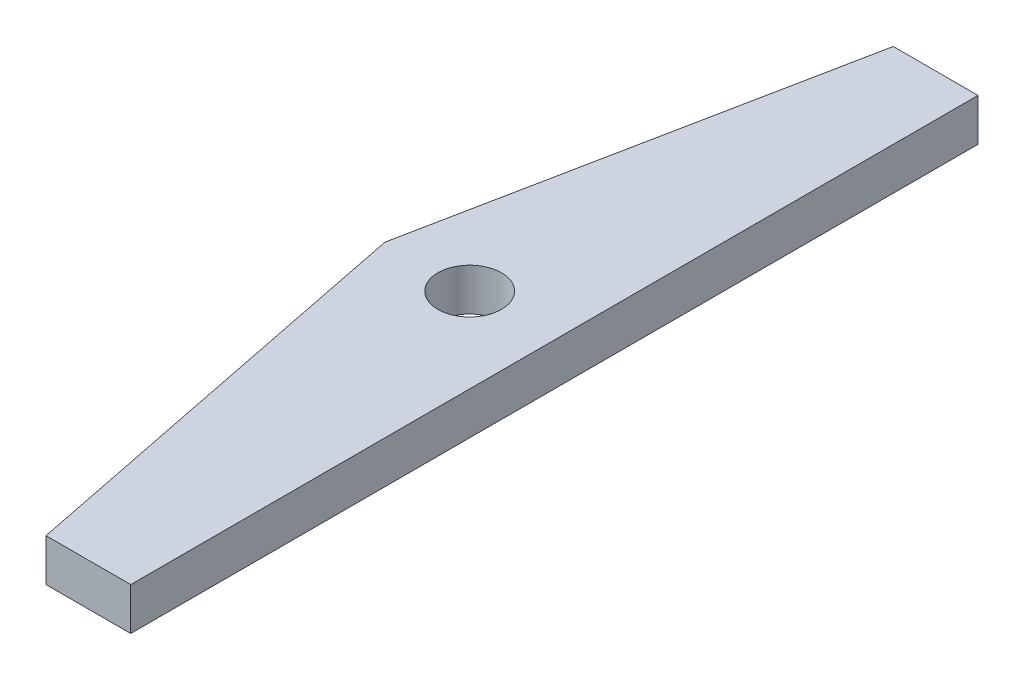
ISO-10303-21;
HEADER;
FILE_DESCRIPTION(('STEP AP214'),'2;1');
FILE_NAME('part.step','',(''),(''),'','','');
FILE_SCHEMA(('AUTOMOTIVE_DESIGN { 1 0 10303 214 1 1 1 1 }'));
ENDSEC;
DATA;
#1=APPLICATION_CONTEXT('core data for automotive mechanical design processes');
#2=APPLICATION_PROTOCOL_DEFINITION('international standard','automotive_design',2000,#1);
#3=PRODUCT_CONTEXT('',#1,'mechanical');
#4=PRODUCT('Part','Part','',(#3));
#5=PRODUCT_RELATED_PRODUCT_CATEGORY('part','',(#4));
#6=PRODUCT_DEFINITION_FORMATION('','',#4);
#7=PRODUCT_DEFINITION_CONTEXT('part definition',#1,'design');
#8=PRODUCT_DEFINITION('design','',#6,#7);
#9=PRODUCT_DEFINITION_SHAPE('','',#8);
#10=(LENGTH_UNIT() NAMED_UNIT(*) SI_UNIT(.MILLI.,.METRE.));
#11=(NAMED_UNIT(*) PLANE_ANGLE_UNIT() SI_UNIT($,.RADIAN.));
#12=(NAMED_UNIT(*) SI_UNIT($,.STERADIAN.) SOLID_ANGLE_UNIT());
#13=UNCERTAINTY_MEASURE_WITH_UNIT(LENGTH_MEASURE(1.E-05),#10,'distance_accuracy_value','');
#14=(GEOMETRIC_REPRESENTATION_CONTEXT(3) GLOBAL_UNCERTAINTY_ASSIGNED_CONTEXT((#13)) GLOBAL_UNIT_ASSIGNED_CONTEXT((#10,
#11,#12)) REPRESENTATION_CONTEXT('',''));
#15=CARTESIAN_POINT('',(0.,0.,0.));
#16=DIRECTION('',(0.,0.,1.));
#17=DIRECTION('',(1.,0.,0.));
#18=AXIS2_PLACEMENT_3D('',#15,#16,#17);
#19=CARTESIAN_POINT('',(0.,3.,-30.));
#20=DIRECTION('',(0.,-1.,0.));
#21=DIRECTION('',(0.,0.,-1.));
#22=AXIS2_PLACEMENT_3D('',#19,#20,#21);
#23=PLANE('',#22);
#24=DIRECTION('',(-1.,0.,0.));
#25=VECTOR('',#24,1.);
#26=CARTESIAN_POINT('',(0.,3.,-30.));
#27=LINE('',#26,#25);
#28=CARTESIAN_POINT('',(0.,3.,-30.));
#29=VERTEX_POINT('',#28);
#30=CARTESIAN_POINT('',(-6.,3.,-30.));
#31=VERTEX_POINT('',#30);
#32=EDGE_CURVE('E115',#29,#31,#27,.T.);
#33=ORIENTED_EDGE('',*,*,#32,.T.);
#34=DIRECTION('',(-0.196116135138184,0.,0.98058067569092));
#35=VECTOR('',#34,1.);
#36=CARTESIAN_POINT('',(-6.,3.,-30.));
#37=LINE('',#36,#35);
#38=CARTESIAN_POINT('',(-12.,3.,0.));
#39=VERTEX_POINT('',#38);
#40=EDGE_CURVE('E82',#31,#39,#37,.T.);
#41=ORIENTED_EDGE('',*,*,#40,.T.);
#42=DIRECTION('',(0.196116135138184,0.,0.98058067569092));
#43=VECTOR('',#42,1.);
#44=CARTESIAN_POINT('',(-6.,3.,30.));
#45=LINE('',#44,#43);
#46=CARTESIAN_POINT('',(-6.,3.,30.));
#47=VERTEX_POINT('',#46);
#48=EDGE_CURVE('E86',#39,#47,#45,.T.);
#49=ORIENTED_EDGE('',*,*,#48,.T.);
#50=DIRECTION('',(1.,0.,0.));
#51=VECTOR('',#50,1.);
#52=CARTESIAN_POINT('',(0.,3.,30.));
#53=LINE('',#52,#51);
#54=CARTESIAN_POINT('',(0.,3.,30.));
#55=VERTEX_POINT('',#54);
#56=EDGE_CURVE('E90',#47,#55,#53,.T.);
#57=ORIENTED_EDGE('',*,*,#56,.T.);
#58=DIRECTION('',(0.,0.,-1.));
#59=VECTOR('',#58,1.);
#60=CARTESIAN_POINT('',(0.,3.,30.));
#61=LINE('',#60,#59);
#62=EDGE_CURVE('E48',#55,#29,#61,.T.);
#63=ORIENTED_EDGE('',*,*,#62,.T.);
#64=EDGE_LOOP('',(#33,#41,#49,#57,#63));
#65=FACE_BOUND('',#64,.T.);
#66=CARTESIAN_POINT('',(-6.,3.,0.));
#67=DIRECTION('',(0.,1.,0.));
#68=DIRECTION('',(0.,0.,1.));
#69=AXIS2_PLACEMENT_3D('',#66,#67,#68);
#70=CIRCLE('',#69,2.25);
#71=CARTESIAN_POINT('',(-6.,3.,2.25));
#72=VERTEX_POINT('',#71);
#73=EDGE_CURVE('E110',#72,#72,#70,.T.);
#74=ORIENTED_EDGE('',*,*,#73,.F.);
#75=EDGE_LOOP('',(#74));
#76=FACE_BOUND('',#75,.T.);
#77=ADVANCED_FACE('F31',(#65,#76),#23,.F.);
#78=CARTESIAN_POINT('',(0.,0.,-30.));
#79=DIRECTION('',(0.,-1.,0.));
#80=DIRECTION('',(0.,0.,-1.));
#81=AXIS2_PLACEMENT_3D('',#78,#79,#80);
#82=PLANE('',#81);
#83=DIRECTION('',(-1.,0.,0.));
#84=VECTOR('',#83,1.);
#85=CARTESIAN_POINT('',(0.,0.,-30.));
#86=LINE('',#85,#84);
#87=CARTESIAN_POINT('',(0.,0.,-30.));
#88=VERTEX_POINT('',#87);
#89=CARTESIAN_POINT('',(-6.,0.,-30.));
#90=VERTEX_POINT('',#89);
#91=EDGE_CURVE('E106',#88,#90,#86,.T.);
#92=ORIENTED_EDGE('',*,*,#91,.F.);
#93=DIRECTION('',(0.,0.,-1.));
#94=VECTOR('',#93,1.);
#95=CARTESIAN_POINT('',(0.,0.,30.));
#96=LINE('',#95,#94);
#97=CARTESIAN_POINT('',(0.,0.,30.));
#98=VERTEX_POINT('',#97);
#99=EDGE_CURVE('E74',#98,#88,#96,.T.);
#100=ORIENTED_EDGE('',*,*,#99,.F.);
#101=DIRECTION('',(1.,0.,0.));
#102=VECTOR('',#101,1.);
#103=CARTESIAN_POINT('',(0.,0.,30.));
#104=LINE('',#103,#102);
#105=CARTESIAN_POINT('',(-6.,0.,30.));
#106=VERTEX_POINT('',#105);
#107=EDGE_CURVE('E68',#106,#98,#104,.T.);
#108=ORIENTED_EDGE('',*,*,#107,.F.);
#109=DIRECTION('',(0.196116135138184,0.,0.98058067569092));
#110=VECTOR('',#109,1.);
#111=CARTESIAN_POINT('',(-6.,0.,30.));
#112=LINE('',#111,#110);
#113=CARTESIAN_POINT('',(-12.,0.,0.));
#114=VERTEX_POINT('',#113);
#115=EDGE_CURVE('E97',#114,#106,#112,.T.);
#116=ORIENTED_EDGE('',*,*,#115,.F.);
#117=DIRECTION('',(-0.196116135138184,0.,0.98058067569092));
#118=VECTOR('',#117,1.);
#119=CARTESIAN_POINT('',(-6.,0.,-30.));
#120=LINE('',#119,#118);
#121=EDGE_CURVE('E109',#90,#114,#120,.T.);
#122=ORIENTED_EDGE('',*,*,#121,.F.);
#123=EDGE_LOOP('',(#92,#100,#108,#116,#122));
#124=FACE_BOUND('',#123,.T.);
#125=CARTESIAN_POINT('',(-6.,0.,0.));
#126=DIRECTION('',(0.,1.,0.));
#127=DIRECTION('',(0.,0.,1.));
#128=AXIS2_PLACEMENT_3D('',#125,#126,#127);
#129=CIRCLE('',#128,2.25);
#130=CARTESIAN_POINT('',(-6.,0.,2.25));
#131=VERTEX_POINT('',#130);
#132=EDGE_CURVE('E195',#131,#131,#129,.T.);
#133=ORIENTED_EDGE('',*,*,#132,.T.);
#134=EDGE_LOOP('',(#133));
#135=FACE_BOUND('',#134,.T.);
#136=ADVANCED_FACE('F119',(#124,#135),#82,.T.);
#137=CARTESIAN_POINT('',(0.,3.,-30.));
#138=DIRECTION('',(0.,0.,1.));
#139=DIRECTION('',(1.,0.,0.));
#140=AXIS2_PLACEMENT_3D('',#137,#138,#139);
#141=PLANE('',#140);
#142=ORIENTED_EDGE('',*,*,#91,.T.);
#143=DIRECTION('',(0.,-1.,0.));
#144=VECTOR('',#143,1.);
#145=CARTESIAN_POINT('',(-6.,3.,-30.));
#146=LINE('',#145,#144);
#147=EDGE_CURVE('E11',#31,#90,#146,.T.);
#148=ORIENTED_EDGE('',*,*,#147,.F.);
#149=ORIENTED_EDGE('',*,*,#32,.F.);
#150=DIRECTION('',(0.,-1.,0.));
#151=VECTOR('',#150,1.);
#152=CARTESIAN_POINT('',(0.,3.,-30.));
#153=LINE('',#152,#151);
#154=EDGE_CURVE('E102',#29,#88,#153,.T.);
#155=ORIENTED_EDGE('',*,*,#154,.T.);
#156=EDGE_LOOP('',(#142,#148,#149,#155));
#157=FACE_BOUND('',#156,.T.);
#158=ADVANCED_FACE('F33',(#157),#141,.F.);
#159=CARTESIAN_POINT('',(-6.,3.,-30.));
#160=DIRECTION('',(0.98058067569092,0.,0.196116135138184));
#161=DIRECTION('',(0.196116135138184,0.,-0.98058067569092));
#162=AXIS2_PLACEMENT_3D('',#159,#160,#161);
#163=PLANE('',#162);
#164=ORIENTED_EDGE('',*,*,#121,.T.);
#165=DIRECTION('',(0.,-1.,0.));
#166=VECTOR('',#165,1.);
#167=CARTESIAN_POINT('',(-12.,3.,0.));
#168=LINE('',#167,#166);
#169=EDGE_CURVE('E40',#39,#114,#168,.T.);
#170=ORIENTED_EDGE('',*,*,#169,.F.);
#171=ORIENTED_EDGE('',*,*,#40,.F.);
#172=ORIENTED_EDGE('',*,*,#147,.T.);
#173=EDGE_LOOP('',(#164,#170,#171,#172));
#174=FACE_BOUND('',#173,.T.);
#175=ADVANCED_FACE('F144',(#174),#163,.F.);
#176=CARTESIAN_POINT('',(-6.,3.,30.));
#177=DIRECTION('',(0.98058067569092,0.,-0.196116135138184));
#178=DIRECTION('',(-0.196116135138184,0.,-0.98058067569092));
#179=AXIS2_PLACEMENT_3D('',#176,#177,#178);
#180=PLANE('',#179);
#181=ORIENTED_EDGE('',*,*,#115,.T.);
#182=DIRECTION('',(0.,-1.,0.));
#183=VECTOR('',#182,1.);
#184=CARTESIAN_POINT('',(-6.,3.,30.));
#185=LINE('',#184,#183);
#186=EDGE_CURVE('E94',#47,#106,#185,.T.);
#187=ORIENTED_EDGE('',*,*,#186,.F.);
#188=ORIENTED_EDGE('',*,*,#48,.F.);
#189=ORIENTED_EDGE('',*,*,#169,.T.);
#190=EDGE_LOOP('',(#181,#187,#188,#189));
#191=FACE_BOUND('',#190,.T.);
#192=ADVANCED_FACE('F95',(#191),#180,.F.);
#193=CARTESIAN_POINT('',(0.,3.,30.));
#194=DIRECTION('',(0.,0.,-1.));
#195=DIRECTION('',(-1.,0.,0.));
#196=AXIS2_PLACEMENT_3D('',#193,#194,#195);
#197=PLANE('',#196);
#198=ORIENTED_EDGE('',*,*,#107,.T.);
#199=DIRECTION('',(0.,-1.,0.));
#200=VECTOR('',#199,1.);
#201=CARTESIAN_POINT('',(0.,3.,30.));
#202=LINE('',#201,#200);
#203=EDGE_CURVE('E98',#55,#98,#202,.T.);
#204=ORIENTED_EDGE('',*,*,#203,.F.);
#205=ORIENTED_EDGE('',*,*,#56,.F.);
#206=ORIENTED_EDGE('',*,*,#186,.T.);
#207=EDGE_LOOP('',(#198,#204,#205,#206));
#208=FACE_BOUND('',#207,.T.);
#209=ADVANCED_FACE('F100',(#208),#197,.F.);
#210=CARTESIAN_POINT('',(0.,3.,30.));
#211=DIRECTION('',(-1.,0.,0.));
#212=DIRECTION('',(0.,0.,1.));
#213=AXIS2_PLACEMENT_3D('',#210,#211,#212);
#214=PLANE('',#213);
#215=ORIENTED_EDGE('',*,*,#99,.T.);
#216=ORIENTED_EDGE('',*,*,#154,.F.);
#217=ORIENTED_EDGE('',*,*,#62,.F.);
#218=ORIENTED_EDGE('',*,*,#203,.T.);
#219=EDGE_LOOP('',(#215,#216,#217,#218));
#220=FACE_BOUND('',#219,.T.);
#221=ADVANCED_FACE('F124',(#220),#214,.F.);
#222=CARTESIAN_POINT('',(-6.,3.,0.));
#223=DIRECTION('',(0.,-1.,0.));
#224=DIRECTION('',(0.,0.,-1.));
#225=AXIS2_PLACEMENT_3D('',#222,#223,#224);
#226=CYLINDRICAL_SURFACE('',#225,2.25);
#227=ORIENTED_EDGE('',*,*,#73,.T.);
#228=EDGE_LOOP('',(#227));
#229=FACE_BOUND('',#228,.T.);
#230=ORIENTED_EDGE('',*,*,#132,.F.);
#231=EDGE_LOOP('',(#230));
#232=FACE_BOUND('',#231,.T.);
#233=ADVANCED_FACE('F126',(#229,#232),#226,.F.);
#234=CLOSED_SHELL('',(#77,#136,#158,#175,#192,#209,#221,#233));
#235=MANIFOLD_SOLID_BREP('B2',#234);
#236=ADVANCED_BREP_SHAPE_REPRESENTATION('',(#18,#235),#14);
#237=SHAPE_DEFINITION_REPRESENTATION(#9,#236);
ENDSEC;
END-ISO-10303-21;
